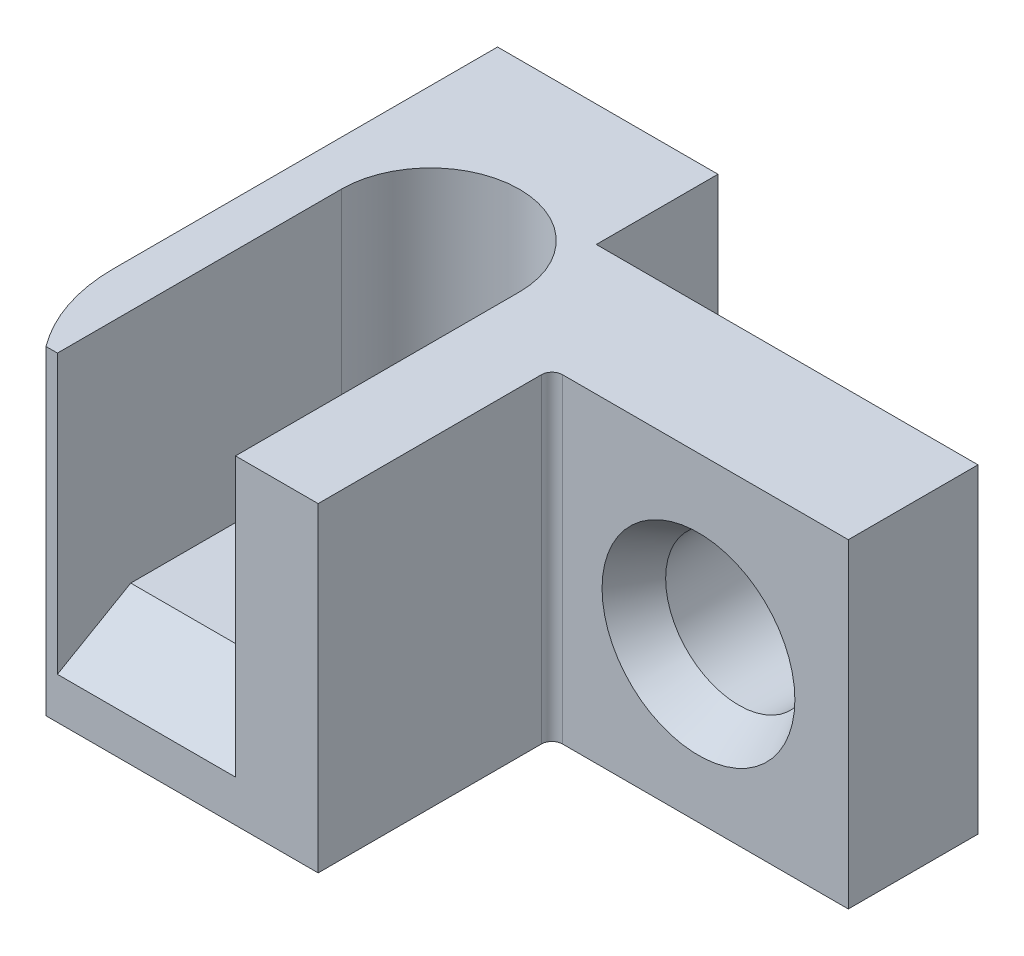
ISO-10303-21;
HEADER;
FILE_DESCRIPTION(('STEP AP214'),'2;1');
FILE_NAME('part.step','',(''),(''),'','','');
FILE_SCHEMA(('AUTOMOTIVE_DESIGN { 1 0 10303 214 1 1 1 1 }'));
ENDSEC;
DATA;
#1=APPLICATION_CONTEXT('core data for automotive mechanical design processes');
#2=APPLICATION_PROTOCOL_DEFINITION('international standard','automotive_design',2000,#1);
#3=PRODUCT_CONTEXT('',#1,'mechanical');
#4=PRODUCT('Part','Part','',(#3));
#5=PRODUCT_RELATED_PRODUCT_CATEGORY('part','',(#4));
#6=PRODUCT_DEFINITION_FORMATION('','',#4);
#7=PRODUCT_DEFINITION_CONTEXT('part definition',#1,'design');
#8=PRODUCT_DEFINITION('design','',#6,#7);
#9=PRODUCT_DEFINITION_SHAPE('','',#8);
#10=(LENGTH_UNIT() NAMED_UNIT(*) SI_UNIT(.MILLI.,.METRE.));
#11=(NAMED_UNIT(*) PLANE_ANGLE_UNIT() SI_UNIT($,.RADIAN.));
#12=(NAMED_UNIT(*) SI_UNIT($,.STERADIAN.) SOLID_ANGLE_UNIT());
#13=UNCERTAINTY_MEASURE_WITH_UNIT(LENGTH_MEASURE(1.E-05),#10,'distance_accuracy_value','');
#14=(GEOMETRIC_REPRESENTATION_CONTEXT(3) GLOBAL_UNCERTAINTY_ASSIGNED_CONTEXT((#13)) GLOBAL_UNIT_ASSIGNED_CONTEXT((#10,
#11,#12)) REPRESENTATION_CONTEXT('',''));
#15=CARTESIAN_POINT('',(0.,0.,0.));
#16=DIRECTION('',(0.,0.,1.));
#17=DIRECTION('',(1.,0.,0.));
#18=AXIS2_PLACEMENT_3D('',#15,#16,#17);
#19=CARTESIAN_POINT('',(8.3312,12.0904,0.));
#20=DIRECTION('',(-1.,0.,0.));
#21=DIRECTION('',(0.,0.,1.));
#22=AXIS2_PLACEMENT_3D('',#19,#20,#21);
#23=PLANE('',#22);
#24=DIRECTION('',(0.,0.,-1.));
#25=VECTOR('',#24,1.);
#26=CARTESIAN_POINT('',(8.3312,3.302,9.26713318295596));
#27=LINE('',#26,#25);
#28=CARTESIAN_POINT('',(8.3312,3.302,4.5974));
#29=VERTEX_POINT('',#28);
#30=CARTESIAN_POINT('',(8.3312,3.302,0.));
#31=VERTEX_POINT('',#30);
#32=EDGE_CURVE('E341',#29,#31,#27,.T.);
#33=ORIENTED_EDGE('',*,*,#32,.T.);
#34=DIRECTION('',(0.,-1.,0.));
#35=VECTOR('',#34,1.);
#36=CARTESIAN_POINT('',(8.3312,12.0904,0.));
#37=LINE('',#36,#35);
#38=CARTESIAN_POINT('',(8.3312,12.0904,0.));
#39=VERTEX_POINT('',#38);
#40=EDGE_CURVE('E171',#39,#31,#37,.T.);
#41=ORIENTED_EDGE('',*,*,#40,.F.);
#42=DIRECTION('',(0.,0.,-1.));
#43=VECTOR('',#42,1.);
#44=CARTESIAN_POINT('',(8.3312,12.0904,0.));
#45=LINE('',#44,#43);
#46=CARTESIAN_POINT('',(8.3312,12.0904,4.5974));
#47=VERTEX_POINT('',#46);
#48=EDGE_CURVE('E299',#47,#39,#45,.T.);
#49=ORIENTED_EDGE('',*,*,#48,.F.);
#50=DIRECTION('',(0.,-1.,0.));
#51=VECTOR('',#50,1.);
#52=CARTESIAN_POINT('',(8.3312,12.0904,4.5974));
#53=LINE('',#52,#51);
#54=EDGE_CURVE('E190',#47,#29,#53,.T.);
#55=ORIENTED_EDGE('',*,*,#54,.T.);
#56=EDGE_LOOP('',(#33,#41,#49,#55));
#57=FACE_BOUND('',#56,.T.);
#58=ADVANCED_FACE('F39',(#57),#23,.F.);
#59=CARTESIAN_POINT('',(11.953875,3.175,9.896475));
#60=DIRECTION('',(0.,1.,0.));
#61=DIRECTION('',(0.,0.,1.));
#62=AXIS2_PLACEMENT_3D('',#59,#60,#61);
#63=PLANE('',#62);
#64=DIRECTION('',(0.,0.,-1.));
#65=VECTOR('',#64,1.);
#66=CARTESIAN_POINT('',(1.7018,3.175,7.6073));
#67=LINE('',#66,#65);
#68=CARTESIAN_POINT('',(1.7018,3.175,15.5671722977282));
#69=VERTEX_POINT('',#68);
#70=CARTESIAN_POINT('',(1.7018,3.175,7.6073));
#71=VERTEX_POINT('',#70);
#72=EDGE_CURVE('E215',#69,#71,#67,.T.);
#73=ORIENTED_EDGE('',*,*,#72,.F.);
#74=DIRECTION('',(-1.,0.,0.));
#75=VECTOR('',#74,1.);
#76=CARTESIAN_POINT('',(11.6332,3.175,15.5671722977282));
#77=LINE('',#76,#75);
#78=CARTESIAN_POINT('',(8.4328,3.175,15.5671722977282));
#79=VERTEX_POINT('',#78);
#80=EDGE_CURVE('E342',#79,#69,#77,.T.);
#81=ORIENTED_EDGE('',*,*,#80,.F.);
#82=DIRECTION('',(0.,0.,1.));
#83=VECTOR('',#82,1.);
#84=CARTESIAN_POINT('',(8.4328,3.175,18.3388));
#85=LINE('',#84,#83);
#86=CARTESIAN_POINT('',(8.4328,3.175,7.6073));
#87=VERTEX_POINT('',#86);
#88=EDGE_CURVE('E327',#87,#79,#85,.T.);
#89=ORIENTED_EDGE('',*,*,#88,.F.);
#90=CARTESIAN_POINT('',(5.0673,3.175,7.6073));
#91=DIRECTION('',(0.,1.,0.));
#92=DIRECTION('',(0.,0.,1.));
#93=AXIS2_PLACEMENT_3D('',#90,#91,#92);
#94=CIRCLE('',#93,3.3655);
#95=EDGE_CURVE('E316',#71,#87,#94,.F.);
#96=ORIENTED_EDGE('',*,*,#95,.F.);
#97=EDGE_LOOP('',(#73,#81,#89,#96));
#98=FACE_BOUND('',#97,.T.);
#99=ADVANCED_FACE('F231',(#98),#63,.T.);
#100=CARTESIAN_POINT('',(0.,12.0904,14.5288));
#101=DIRECTION('',(1.,0.,0.));
#102=DIRECTION('',(0.,0.,-1.));
#103=AXIS2_PLACEMENT_3D('',#100,#101,#102);
#104=PLANE('',#103);
#105=DIRECTION('',(0.,0.,1.));
#106=VECTOR('',#105,1.);
#107=CARTESIAN_POINT('',(0.,0.,14.5288));
#108=LINE('',#107,#106);
#109=CARTESIAN_POINT('',(0.,0.,0.));
#110=VERTEX_POINT('',#109);
#111=CARTESIAN_POINT('',(0.,0.,14.5288));
#112=VERTEX_POINT('',#111);
#113=EDGE_CURVE('E176',#110,#112,#108,.T.);
#114=ORIENTED_EDGE('',*,*,#113,.T.);
#115=DIRECTION('',(0.,-1.,0.));
#116=VECTOR('',#115,1.);
#117=CARTESIAN_POINT('',(0.,12.0904,14.5288));
#118=LINE('',#117,#116);
#119=CARTESIAN_POINT('',(0.,12.0904,14.5288));
#120=VERTEX_POINT('',#119);
#121=EDGE_CURVE('E210',#120,#112,#118,.T.);
#122=ORIENTED_EDGE('',*,*,#121,.F.);
#123=DIRECTION('',(0.,0.,1.));
#124=VECTOR('',#123,1.);
#125=CARTESIAN_POINT('',(0.,12.0904,14.5288));
#126=LINE('',#125,#124);
#127=CARTESIAN_POINT('',(0.,12.0904,0.));
#128=VERTEX_POINT('',#127);
#129=EDGE_CURVE('E177',#128,#120,#126,.T.);
#130=ORIENTED_EDGE('',*,*,#129,.F.);
#131=DIRECTION('',(0.,-1.,0.));
#132=VECTOR('',#131,1.);
#133=CARTESIAN_POINT('',(0.,12.0904,0.));
#134=LINE('',#133,#132);
#135=EDGE_CURVE('E186',#128,#110,#134,.T.);
#136=ORIENTED_EDGE('',*,*,#135,.T.);
#137=EDGE_LOOP('',(#114,#122,#130,#136));
#138=FACE_BOUND('',#137,.T.);
#139=ADVANCED_FACE('F237',(#138),#104,.F.);
#140=CARTESIAN_POINT('',(6.35,12.0904,14.5288));
#141=DIRECTION('',(0.,-1.,0.));
#142=DIRECTION('',(0.,0.,-1.));
#143=AXIS2_PLACEMENT_3D('',#140,#141,#142);
#144=CYLINDRICAL_SURFACE('',#143,6.35);
#145=CARTESIAN_POINT('',(6.35,0.,14.5288));
#146=DIRECTION('',(0.,1.,0.));
#147=DIRECTION('',(0.,0.,-1.));
#148=AXIS2_PLACEMENT_3D('',#145,#146,#147);
#149=CIRCLE('',#148,6.35);
#150=CARTESIAN_POINT('',(1.27,0.,18.3388));
#151=VERTEX_POINT('',#150);
#152=EDGE_CURVE('E276',#112,#151,#149,.T.);
#153=ORIENTED_EDGE('',*,*,#152,.T.);
#154=DIRECTION('',(0.,-1.,0.));
#155=VECTOR('',#154,1.);
#156=CARTESIAN_POINT('',(1.27,12.0904,18.3388));
#157=LINE('',#156,#155);
#158=CARTESIAN_POINT('',(1.27,12.0904,18.3388));
#159=VERTEX_POINT('',#158);
#160=EDGE_CURVE('E207',#159,#151,#157,.T.);
#161=ORIENTED_EDGE('',*,*,#160,.F.);
#162=CARTESIAN_POINT('',(6.35,12.0904,14.5288));
#163=DIRECTION('',(0.,1.,0.));
#164=DIRECTION('',(0.,0.,-1.));
#165=AXIS2_PLACEMENT_3D('',#162,#163,#164);
#166=CIRCLE('',#165,6.35);
#167=EDGE_CURVE('E180',#120,#159,#166,.T.);
#168=ORIENTED_EDGE('',*,*,#167,.F.);
#169=ORIENTED_EDGE('',*,*,#121,.T.);
#170=EDGE_LOOP('',(#153,#161,#168,#169));
#171=FACE_BOUND('',#170,.T.);
#172=ADVANCED_FACE('F266',(#171),#144,.T.);
#173=CARTESIAN_POINT('',(11.557,12.0904,18.3388));
#174=DIRECTION('',(0.,0.,-1.));
#175=DIRECTION('',(-1.,0.,0.));
#176=AXIS2_PLACEMENT_3D('',#173,#174,#175);
#177=PLANE('',#176);
#178=DIRECTION('',(-1.,0.,0.));
#179=VECTOR('',#178,1.);
#180=CARTESIAN_POINT('',(11.6332,1.5748,18.3388));
#181=LINE('',#180,#179);
#182=CARTESIAN_POINT('',(8.4328,1.5748,18.3388));
#183=VERTEX_POINT('',#182);
#184=CARTESIAN_POINT('',(1.7018,1.5748,18.3388));
#185=VERTEX_POINT('',#184);
#186=EDGE_CURVE('E337',#183,#185,#181,.T.);
#187=ORIENTED_EDGE('',*,*,#186,.T.);
#188=DIRECTION('',(0.,1.,0.));
#189=VECTOR('',#188,1.);
#190=CARTESIAN_POINT('',(1.7018,-15.6215162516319,18.3388));
#191=LINE('',#190,#189);
#192=CARTESIAN_POINT('',(1.7018,12.0904,18.3388));
#193=VERTEX_POINT('',#192);
#194=EDGE_CURVE('E319',#185,#193,#191,.T.);
#195=ORIENTED_EDGE('',*,*,#194,.T.);
#196=DIRECTION('',(1.,0.,0.));
#197=VECTOR('',#196,1.);
#198=CARTESIAN_POINT('',(11.557,12.0904,18.3388));
#199=LINE('',#198,#197);
#200=EDGE_CURVE('E310',#159,#193,#199,.T.);
#201=ORIENTED_EDGE('',*,*,#200,.F.);
#202=ORIENTED_EDGE('',*,*,#160,.T.);
#203=DIRECTION('',(1.,0.,0.));
#204=VECTOR('',#203,1.);
#205=CARTESIAN_POINT('',(11.557,0.,18.3388));
#206=LINE('',#205,#204);
#207=CARTESIAN_POINT('',(11.557,0.,18.3388));
#208=VERTEX_POINT('',#207);
#209=EDGE_CURVE('E278',#151,#208,#206,.T.);
#210=ORIENTED_EDGE('',*,*,#209,.T.);
#211=DIRECTION('',(0.,-1.,0.));
#212=VECTOR('',#211,1.);
#213=CARTESIAN_POINT('',(11.557,12.0904,18.3388));
#214=LINE('',#213,#212);
#215=CARTESIAN_POINT('',(11.557,12.0904,18.3388));
#216=VERTEX_POINT('',#215);
#217=EDGE_CURVE('E204',#216,#208,#214,.T.);
#218=ORIENTED_EDGE('',*,*,#217,.F.);
#219=CARTESIAN_POINT('',(8.4328,12.0904,18.3388));
#220=VERTEX_POINT('',#219);
#221=EDGE_CURVE('E313',#220,#216,#199,.T.);
#222=ORIENTED_EDGE('',*,*,#221,.F.);
#223=DIRECTION('',(0.,1.,0.));
#224=VECTOR('',#223,1.);
#225=CARTESIAN_POINT('',(8.4328,-15.6215162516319,18.3388));
#226=LINE('',#225,#224);
#227=EDGE_CURVE('E323',#183,#220,#226,.T.);
#228=ORIENTED_EDGE('',*,*,#227,.F.);
#229=EDGE_LOOP('',(#187,#195,#201,#202,#210,#218,#222,#228));
#230=FACE_BOUND('',#229,.T.);
#231=ADVANCED_FACE('F262',(#230),#177,.F.);
#232=CARTESIAN_POINT('',(11.557,12.0904,9.89647500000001));
#233=DIRECTION('',(-1.,0.,0.));
#234=DIRECTION('',(0.,0.,1.));
#235=AXIS2_PLACEMENT_3D('',#232,#233,#234);
#236=PLANE('',#235);
#237=DIRECTION('',(0.,0.,-1.));
#238=VECTOR('',#237,1.);
#239=CARTESIAN_POINT('',(11.557,0.,9.89647500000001));
#240=LINE('',#239,#238);
#241=CARTESIAN_POINT('',(11.557,0.,9.89647500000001));
#242=VERTEX_POINT('',#241);
#243=EDGE_CURVE('E284',#208,#242,#240,.T.);
#244=ORIENTED_EDGE('',*,*,#243,.T.);
#245=DIRECTION('',(0.,-1.,0.));
#246=VECTOR('',#245,1.);
#247=CARTESIAN_POINT('',(11.557,12.0904,9.89647500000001));
#248=LINE('',#247,#246);
#249=CARTESIAN_POINT('',(11.557,12.0904,9.89647500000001));
#250=VERTEX_POINT('',#249);
#251=EDGE_CURVE('E201',#250,#242,#248,.T.);
#252=ORIENTED_EDGE('',*,*,#251,.F.);
#253=DIRECTION('',(0.,0.,-1.));
#254=VECTOR('',#253,1.);
#255=CARTESIAN_POINT('',(11.557,12.0904,9.89647500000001));
#256=LINE('',#255,#254);
#257=EDGE_CURVE('E308',#216,#250,#256,.T.);
#258=ORIENTED_EDGE('',*,*,#257,.F.);
#259=ORIENTED_EDGE('',*,*,#217,.T.);
#260=EDGE_LOOP('',(#244,#252,#258,#259));
#261=FACE_BOUND('',#260,.T.);
#262=ADVANCED_FACE('F258',(#261),#236,.F.);
#263=CARTESIAN_POINT('',(11.953875,12.0904,9.896475));
#264=DIRECTION('',(0.,-1.,0.));
#265=DIRECTION('',(0.,0.,-1.));
#266=AXIS2_PLACEMENT_3D('',#263,#264,#265);
#267=CYLINDRICAL_SURFACE('',#266,0.396875);
#268=CARTESIAN_POINT('',(11.953875,0.,9.896475));
#269=DIRECTION('',(0.,-1.,0.));
#270=DIRECTION('',(0.,0.,1.));
#271=AXIS2_PLACEMENT_3D('',#268,#269,#270);
#272=CIRCLE('',#271,0.396875);
#273=CARTESIAN_POINT('',(11.953875,0.,9.4996));
#274=VERTEX_POINT('',#273);
#275=EDGE_CURVE('E286',#242,#274,#272,.T.);
#276=ORIENTED_EDGE('',*,*,#275,.T.);
#277=DIRECTION('',(0.,-1.,0.));
#278=VECTOR('',#277,1.);
#279=CARTESIAN_POINT('',(11.953875,12.0904,9.4996));
#280=LINE('',#279,#278);
#281=CARTESIAN_POINT('',(11.953875,12.0904,9.4996));
#282=VERTEX_POINT('',#281);
#283=EDGE_CURVE('E198',#282,#274,#280,.T.);
#284=ORIENTED_EDGE('',*,*,#283,.F.);
#285=CARTESIAN_POINT('',(11.953875,12.0904,9.896475));
#286=DIRECTION('',(0.,-1.,0.));
#287=DIRECTION('',(0.,0.,1.));
#288=AXIS2_PLACEMENT_3D('',#285,#286,#287);
#289=CIRCLE('',#288,0.396875);
#290=EDGE_CURVE('E306',#250,#282,#289,.T.);
#291=ORIENTED_EDGE('',*,*,#290,.F.);
#292=ORIENTED_EDGE('',*,*,#251,.T.);
#293=EDGE_LOOP('',(#276,#284,#291,#292));
#294=FACE_BOUND('',#293,.T.);
#295=ADVANCED_FACE('F254',(#294),#267,.F.);
#296=CARTESIAN_POINT('',(22.7584,12.0904,9.4996));
#297=DIRECTION('',(0.,0.,-1.));
#298=DIRECTION('',(-1.,0.,0.));
#299=AXIS2_PLACEMENT_3D('',#296,#297,#298);
#300=PLANE('',#299);
#301=CARTESIAN_POINT('',(17.0942,5.842,9.4996));
#302=DIRECTION('',(0.,0.,-1.));
#303=DIRECTION('',(-1.,0.,0.));
#304=AXIS2_PLACEMENT_3D('',#301,#302,#303);
#305=CIRCLE('',#304,3.64467181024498);
#306=CARTESIAN_POINT('',(13.449528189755,5.842,9.4996));
#307=VERTEX_POINT('',#306);
#308=EDGE_CURVE('E12',#307,#307,#305,.T.);
#309=ORIENTED_EDGE('',*,*,#308,.T.);
#310=EDGE_LOOP('',(#309));
#311=FACE_BOUND('',#310,.T.);
#312=DIRECTION('',(1.,0.,0.));
#313=VECTOR('',#312,1.);
#314=CARTESIAN_POINT('',(22.7584,0.,9.4996));
#315=LINE('',#314,#313);
#316=CARTESIAN_POINT('',(22.7584,0.,9.4996));
#317=VERTEX_POINT('',#316);
#318=EDGE_CURVE('E288',#274,#317,#315,.T.);
#319=ORIENTED_EDGE('',*,*,#318,.T.);
#320=DIRECTION('',(0.,-1.,0.));
#321=VECTOR('',#320,1.);
#322=CARTESIAN_POINT('',(22.7584,12.0904,9.4996));
#323=LINE('',#322,#321);
#324=CARTESIAN_POINT('',(22.7584,12.0904,9.4996));
#325=VERTEX_POINT('',#324);
#326=EDGE_CURVE('E195',#325,#317,#323,.T.);
#327=ORIENTED_EDGE('',*,*,#326,.F.);
#328=DIRECTION('',(1.,0.,0.));
#329=VECTOR('',#328,1.);
#330=CARTESIAN_POINT('',(22.7584,12.0904,9.4996));
#331=LINE('',#330,#329);
#332=EDGE_CURVE('E302',#282,#325,#331,.T.);
#333=ORIENTED_EDGE('',*,*,#332,.F.);
#334=ORIENTED_EDGE('',*,*,#283,.T.);
#335=EDGE_LOOP('',(#319,#327,#333,#334));
#336=FACE_BOUND('',#335,.T.);
#337=ADVANCED_FACE('F250',(#311,#336),#300,.F.);
#338=CARTESIAN_POINT('',(22.7584,12.0904,4.5974));
#339=DIRECTION('',(-1.,0.,0.));
#340=DIRECTION('',(0.,0.,1.));
#341=AXIS2_PLACEMENT_3D('',#338,#339,#340);
#342=PLANE('',#341);
#343=DIRECTION('',(0.,0.,-1.));
#344=VECTOR('',#343,1.);
#345=CARTESIAN_POINT('',(22.7584,0.,4.5974));
#346=LINE('',#345,#344);
#347=CARTESIAN_POINT('',(22.7584,0.,4.5974));
#348=VERTEX_POINT('',#347);
#349=EDGE_CURVE('E182',#317,#348,#346,.T.);
#350=ORIENTED_EDGE('',*,*,#349,.T.);
#351=DIRECTION('',(0.,-1.,0.));
#352=VECTOR('',#351,1.);
#353=CARTESIAN_POINT('',(22.7584,12.0904,4.5974));
#354=LINE('',#353,#352);
#355=CARTESIAN_POINT('',(22.7584,12.0904,4.5974));
#356=VERTEX_POINT('',#355);
#357=EDGE_CURVE('E193',#356,#348,#354,.T.);
#358=ORIENTED_EDGE('',*,*,#357,.F.);
#359=DIRECTION('',(0.,0.,-1.));
#360=VECTOR('',#359,1.);
#361=CARTESIAN_POINT('',(22.7584,12.0904,4.5974));
#362=LINE('',#361,#360);
#363=EDGE_CURVE('E300',#325,#356,#362,.T.);
#364=ORIENTED_EDGE('',*,*,#363,.F.);
#365=ORIENTED_EDGE('',*,*,#326,.T.);
#366=EDGE_LOOP('',(#350,#358,#364,#365));
#367=FACE_BOUND('',#366,.T.);
#368=ADVANCED_FACE('F246',(#367),#342,.F.);
#369=CARTESIAN_POINT('',(8.3312,12.0904,4.5974));
#370=DIRECTION('',(0.,0.,1.));
#371=DIRECTION('',(1.,0.,0.));
#372=AXIS2_PLACEMENT_3D('',#369,#370,#371);
#373=PLANE('',#372);
#374=CARTESIAN_POINT('',(17.0942,5.842,4.5974));
#375=DIRECTION('',(0.,0.,1.));
#376=DIRECTION('',(1.,0.,0.));
#377=AXIS2_PLACEMENT_3D('',#374,#375,#376);
#378=CIRCLE('',#377,2.76479);
#379=CARTESIAN_POINT('',(19.85899,5.842,4.5974));
#380=VERTEX_POINT('',#379);
#381=EDGE_CURVE('E213',#380,#380,#378,.T.);
#382=ORIENTED_EDGE('',*,*,#381,.T.);
#383=EDGE_LOOP('',(#382));
#384=FACE_BOUND('',#383,.T.);
#385=DIRECTION('',(-1.,0.,0.));
#386=VECTOR('',#385,1.);
#387=CARTESIAN_POINT('',(8.3312,0.,4.5974));
#388=LINE('',#387,#386);
#389=CARTESIAN_POINT('',(5.0292,0.,4.5974));
#390=VERTEX_POINT('',#389);
#391=EDGE_CURVE('E54',#348,#390,#388,.T.);
#392=ORIENTED_EDGE('',*,*,#391,.T.);
#393=CARTESIAN_POINT('',(5.0292,3.302,4.5974));
#394=DIRECTION('',(0.,0.,1.));
#395=DIRECTION('',(1.,0.,0.));
#396=AXIS2_PLACEMENT_3D('',#393,#394,#395);
#397=CIRCLE('',#396,3.302);
#398=EDGE_CURVE('E159',#390,#29,#397,.T.);
#399=ORIENTED_EDGE('',*,*,#398,.T.);
#400=ORIENTED_EDGE('',*,*,#54,.F.);
#401=DIRECTION('',(-1.,0.,0.));
#402=VECTOR('',#401,1.);
#403=CARTESIAN_POINT('',(8.3312,12.0904,4.5974));
#404=LINE('',#403,#402);
#405=EDGE_CURVE('E296',#356,#47,#404,.T.);
#406=ORIENTED_EDGE('',*,*,#405,.F.);
#407=ORIENTED_EDGE('',*,*,#357,.T.);
#408=EDGE_LOOP('',(#392,#399,#400,#406,#407));
#409=FACE_BOUND('',#408,.T.);
#410=ADVANCED_FACE('F243',(#384,#409),#373,.F.);
#411=CARTESIAN_POINT('',(0.,12.0904,0.));
#412=DIRECTION('',(0.,0.,1.));
#413=DIRECTION('',(1.,0.,0.));
#414=AXIS2_PLACEMENT_3D('',#411,#412,#413);
#415=PLANE('',#414);
#416=ORIENTED_EDGE('',*,*,#40,.T.);
#417=CARTESIAN_POINT('',(5.0292,3.302,0.));
#418=DIRECTION('',(0.,0.,1.));
#419=DIRECTION('',(1.,0.,0.));
#420=AXIS2_PLACEMENT_3D('',#417,#418,#419);
#421=CIRCLE('',#420,3.302);
#422=CARTESIAN_POINT('',(5.0292,0.,0.));
#423=VERTEX_POINT('',#422);
#424=EDGE_CURVE('E157',#423,#31,#421,.T.);
#425=ORIENTED_EDGE('',*,*,#424,.F.);
#426=DIRECTION('',(-1.,0.,0.));
#427=VECTOR('',#426,1.);
#428=CARTESIAN_POINT('',(0.,0.,0.));
#429=LINE('',#428,#427);
#430=EDGE_CURVE('E167',#423,#110,#429,.T.);
#431=ORIENTED_EDGE('',*,*,#430,.T.);
#432=ORIENTED_EDGE('',*,*,#135,.F.);
#433=DIRECTION('',(-1.,0.,0.));
#434=VECTOR('',#433,1.);
#435=CARTESIAN_POINT('',(0.,12.0904,0.));
#436=LINE('',#435,#434);
#437=EDGE_CURVE('E188',#39,#128,#436,.T.);
#438=ORIENTED_EDGE('',*,*,#437,.F.);
#439=EDGE_LOOP('',(#416,#425,#431,#432,#438));
#440=FACE_BOUND('',#439,.T.);
#441=ADVANCED_FACE('F165',(#440),#415,.F.);
#442=CARTESIAN_POINT('',(11.953875,12.0904,9.896475));
#443=DIRECTION('',(0.,1.,0.));
#444=DIRECTION('',(0.,0.,1.));
#445=AXIS2_PLACEMENT_3D('',#442,#443,#444);
#446=PLANE('',#445);
#447=DIRECTION('',(0.,0.,-1.));
#448=VECTOR('',#447,1.);
#449=CARTESIAN_POINT('',(8.4328,12.0904,18.3388));
#450=LINE('',#449,#448);
#451=CARTESIAN_POINT('',(8.4328,12.0904,7.6073));
#452=VERTEX_POINT('',#451);
#453=EDGE_CURVE('E320',#220,#452,#450,.T.);
#454=ORIENTED_EDGE('',*,*,#453,.F.);
#455=ORIENTED_EDGE('',*,*,#221,.T.);
#456=ORIENTED_EDGE('',*,*,#257,.T.);
#457=ORIENTED_EDGE('',*,*,#290,.T.);
#458=ORIENTED_EDGE('',*,*,#332,.T.);
#459=ORIENTED_EDGE('',*,*,#363,.T.);
#460=ORIENTED_EDGE('',*,*,#405,.T.);
#461=ORIENTED_EDGE('',*,*,#48,.T.);
#462=ORIENTED_EDGE('',*,*,#437,.T.);
#463=ORIENTED_EDGE('',*,*,#129,.T.);
#464=ORIENTED_EDGE('',*,*,#167,.T.);
#465=ORIENTED_EDGE('',*,*,#200,.T.);
#466=DIRECTION('',(0.,0.,1.));
#467=VECTOR('',#466,1.);
#468=CARTESIAN_POINT('',(1.7018,12.0904,7.6073));
#469=LINE('',#468,#467);
#470=CARTESIAN_POINT('',(1.7018,12.0904,7.6073));
#471=VERTEX_POINT('',#470);
#472=EDGE_CURVE('E330',#471,#193,#469,.T.);
#473=ORIENTED_EDGE('',*,*,#472,.F.);
#474=CARTESIAN_POINT('',(5.0673,12.0904,7.6073));
#475=DIRECTION('',(0.,1.,0.));
#476=DIRECTION('',(0.,0.,1.));
#477=AXIS2_PLACEMENT_3D('',#474,#475,#476);
#478=CIRCLE('',#477,3.3655);
#479=EDGE_CURVE('E62',#452,#471,#478,.T.);
#480=ORIENTED_EDGE('',*,*,#479,.F.);
#481=EDGE_LOOP('',(#454,#455,#456,#457,#458,#459,#460,#461,#462,#463,#464,#465,#473,#480));
#482=FACE_BOUND('',#481,.T.);
#483=ADVANCED_FACE('F349',(#482),#446,.T.);
#484=CARTESIAN_POINT('',(11.953875,0.,9.896475));
#485=DIRECTION('',(0.,1.,0.));
#486=DIRECTION('',(0.,0.,1.));
#487=AXIS2_PLACEMENT_3D('',#484,#485,#486);
#488=PLANE('',#487);
#489=DIRECTION('',(0.,0.,-1.));
#490=VECTOR('',#489,1.);
#491=CARTESIAN_POINT('',(5.0292,0.,9.26713318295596));
#492=LINE('',#491,#490);
#493=EDGE_CURVE('E153',#390,#423,#492,.T.);
#494=ORIENTED_EDGE('',*,*,#493,.F.);
#495=ORIENTED_EDGE('',*,*,#391,.F.);
#496=ORIENTED_EDGE('',*,*,#349,.F.);
#497=ORIENTED_EDGE('',*,*,#318,.F.);
#498=ORIENTED_EDGE('',*,*,#275,.F.);
#499=ORIENTED_EDGE('',*,*,#243,.F.);
#500=ORIENTED_EDGE('',*,*,#209,.F.);
#501=ORIENTED_EDGE('',*,*,#152,.F.);
#502=ORIENTED_EDGE('',*,*,#113,.F.);
#503=ORIENTED_EDGE('',*,*,#430,.F.);
#504=EDGE_LOOP('',(#494,#495,#496,#497,#498,#499,#500,#501,#502,#503));
#505=FACE_BOUND('',#504,.T.);
#506=ADVANCED_FACE('F174',(#505),#488,.F.);
#507=CARTESIAN_POINT('',(17.0942,5.842,0.));
#508=DIRECTION('',(0.,0.,1.));
#509=DIRECTION('',(1.,0.,0.));
#510=AXIS2_PLACEMENT_3D('',#507,#508,#509);
#511=CYLINDRICAL_SURFACE('',#510,2.76479);
#512=CARTESIAN_POINT('',(17.0942,5.842,7.9756));
#513=DIRECTION('',(0.,0.,-1.));
#514=DIRECTION('',(-1.,0.,0.));
#515=AXIS2_PLACEMENT_3D('',#512,#513,#514);
#516=CIRCLE('',#515,2.76479);
#517=CARTESIAN_POINT('',(14.32941,5.842,7.9756));
#518=VERTEX_POINT('',#517);
#519=EDGE_CURVE('E47',#518,#518,#516,.F.);
#520=ORIENTED_EDGE('',*,*,#519,.T.);
#521=EDGE_LOOP('',(#520));
#522=FACE_BOUND('',#521,.T.);
#523=ORIENTED_EDGE('',*,*,#381,.F.);
#524=EDGE_LOOP('',(#523));
#525=FACE_BOUND('',#524,.T.);
#526=ADVANCED_FACE('F219',(#522,#525),#511,.F.);
#527=CARTESIAN_POINT('',(5.0673,-15.6215162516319,7.6073));
#528=DIRECTION('',(0.,1.,0.));
#529=DIRECTION('',(0.,0.,1.));
#530=AXIS2_PLACEMENT_3D('',#527,#528,#529);
#531=CYLINDRICAL_SURFACE('',#530,3.3655);
#532=ORIENTED_EDGE('',*,*,#95,.T.);
#533=DIRECTION('',(0.,1.,0.));
#534=VECTOR('',#533,1.);
#535=CARTESIAN_POINT('',(8.4328,-15.6215162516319,7.6073));
#536=LINE('',#535,#534);
#537=EDGE_CURVE('E325',#87,#452,#536,.T.);
#538=ORIENTED_EDGE('',*,*,#537,.T.);
#539=ORIENTED_EDGE('',*,*,#479,.T.);
#540=DIRECTION('',(0.,1.,0.));
#541=VECTOR('',#540,1.);
#542=CARTESIAN_POINT('',(1.7018,-15.6215162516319,7.6073));
#543=LINE('',#542,#541);
#544=EDGE_CURVE('E317',#71,#471,#543,.T.);
#545=ORIENTED_EDGE('',*,*,#544,.F.);
#546=EDGE_LOOP('',(#532,#538,#539,#545));
#547=FACE_BOUND('',#546,.T.);
#548=ADVANCED_FACE('F367',(#547),#531,.F.);
#549=CARTESIAN_POINT('',(8.4328,-15.6215162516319,18.3388));
#550=DIRECTION('',(1.,0.,0.));
#551=DIRECTION('',(0.,0.,-1.));
#552=AXIS2_PLACEMENT_3D('',#549,#550,#551);
#553=PLANE('',#552);
#554=ORIENTED_EDGE('',*,*,#88,.T.);
#555=DIRECTION('',(0.,0.499999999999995,-0.866025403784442));
#556=VECTOR('',#555,1.);
#557=CARTESIAN_POINT('',(8.4328,1.5748,18.3388));
#558=LINE('',#557,#556);
#559=EDGE_CURVE('E333',#183,#79,#558,.T.);
#560=ORIENTED_EDGE('',*,*,#559,.F.);
#561=ORIENTED_EDGE('',*,*,#227,.T.);
#562=ORIENTED_EDGE('',*,*,#453,.T.);
#563=ORIENTED_EDGE('',*,*,#537,.F.);
#564=EDGE_LOOP('',(#554,#560,#561,#562,#563));
#565=FACE_BOUND('',#564,.T.);
#566=ADVANCED_FACE('F366',(#565),#553,.F.);
#567=CARTESIAN_POINT('',(1.7018,-15.6215162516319,7.6073));
#568=DIRECTION('',(-1.,0.,0.));
#569=DIRECTION('',(0.,0.,1.));
#570=AXIS2_PLACEMENT_3D('',#567,#568,#569);
#571=PLANE('',#570);
#572=ORIENTED_EDGE('',*,*,#194,.F.);
#573=DIRECTION('',(0.,0.499999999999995,-0.866025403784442));
#574=VECTOR('',#573,1.);
#575=CARTESIAN_POINT('',(1.7018,1.5748,18.3388));
#576=LINE('',#575,#574);
#577=EDGE_CURVE('E340',#185,#69,#576,.T.);
#578=ORIENTED_EDGE('',*,*,#577,.T.);
#579=ORIENTED_EDGE('',*,*,#72,.T.);
#580=ORIENTED_EDGE('',*,*,#544,.T.);
#581=ORIENTED_EDGE('',*,*,#472,.T.);
#582=EDGE_LOOP('',(#572,#578,#579,#580,#581));
#583=FACE_BOUND('',#582,.T.);
#584=ADVANCED_FACE('F357',(#583),#571,.F.);
#585=CARTESIAN_POINT('',(11.6332,1.5748,18.3388));
#586=DIRECTION('',(0.,0.866025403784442,0.499999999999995));
#587=DIRECTION('',(0.,-0.499999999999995,0.866025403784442));
#588=AXIS2_PLACEMENT_3D('',#585,#586,#587);
#589=PLANE('',#588);
#590=ORIENTED_EDGE('',*,*,#559,.T.);
#591=ORIENTED_EDGE('',*,*,#80,.T.);
#592=ORIENTED_EDGE('',*,*,#577,.F.);
#593=ORIENTED_EDGE('',*,*,#186,.F.);
#594=EDGE_LOOP('',(#590,#591,#592,#593));
#595=FACE_BOUND('',#594,.T.);
#596=ADVANCED_FACE('F227',(#595),#589,.T.);
#597=CARTESIAN_POINT('',(5.0292,3.302,9.26713318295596));
#598=DIRECTION('',(0.,0.,-1.));
#599=DIRECTION('',(-1.,0.,0.));
#600=AXIS2_PLACEMENT_3D('',#597,#598,#599);
#601=CYLINDRICAL_SURFACE('',#600,3.302);
#602=ORIENTED_EDGE('',*,*,#493,.T.);
#603=ORIENTED_EDGE('',*,*,#424,.T.);
#604=ORIENTED_EDGE('',*,*,#32,.F.);
#605=ORIENTED_EDGE('',*,*,#398,.F.);
#606=EDGE_LOOP('',(#602,#603,#604,#605));
#607=FACE_BOUND('',#606,.T.);
#608=ADVANCED_FACE('F155',(#607),#601,.T.);
#609=CARTESIAN_POINT('',(17.0942,5.842,7.9756));
#610=DIRECTION('',(0.,0.,1.));
#611=DIRECTION('',(1.,0.,0.));
#612=AXIS2_PLACEMENT_3D('',#609,#610,#611);
#613=CONICAL_SURFACE('',#612,2.76479,0.523598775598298);
#614=ORIENTED_EDGE('',*,*,#308,.F.);
#615=EDGE_LOOP('',(#614));
#616=FACE_BOUND('',#615,.T.);
#617=ORIENTED_EDGE('',*,*,#519,.F.);
#618=EDGE_LOOP('',(#617));
#619=FACE_BOUND('',#618,.T.);
#620=ADVANCED_FACE('F41',(#616,#619),#613,.F.);
#621=CLOSED_SHELL('',(#58,#99,#139,#172,#231,#262,#295,#337,#368,#410,#441,#483,#506,#526,#548,
#566,#584,#596,#608,#620));
#622=MANIFOLD_SOLID_BREP('B2',#621);
#623=ADVANCED_BREP_SHAPE_REPRESENTATION('',(#18,#622),#14);
#624=SHAPE_DEFINITION_REPRESENTATION(#9,#623);
ENDSEC;
END-ISO-10303-21;
